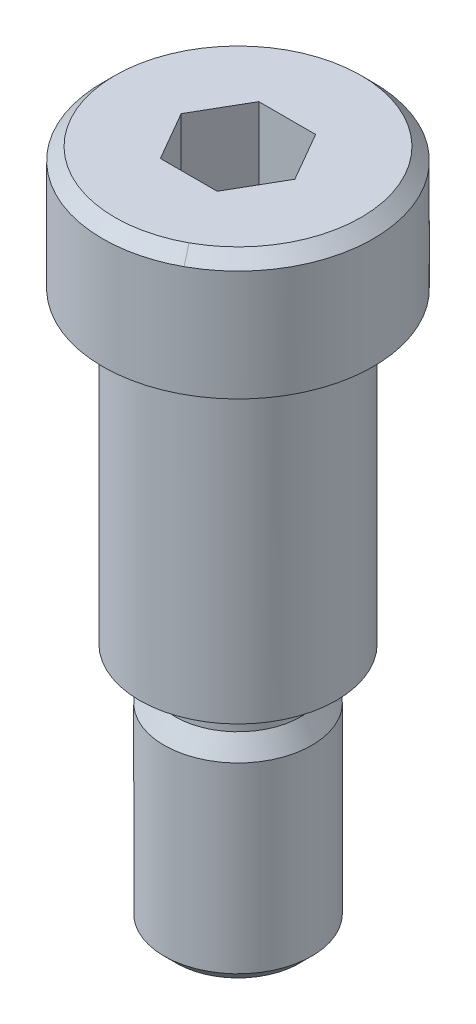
ISO-10303-21;
HEADER;
FILE_DESCRIPTION(('STEP AP214'),'2;1');
FILE_NAME('part.step','',(''),(''),'','','');
FILE_SCHEMA(('AUTOMOTIVE_DESIGN { 1 0 10303 214 1 1 1 1 }'));
ENDSEC;
DATA;
#1=APPLICATION_CONTEXT('core data for automotive mechanical design processes');
#2=APPLICATION_PROTOCOL_DEFINITION('international standard','automotive_design',2000,#1);
#3=PRODUCT_CONTEXT('',#1,'mechanical');
#4=PRODUCT('Part','Part','',(#3));
#5=PRODUCT_RELATED_PRODUCT_CATEGORY('part','',(#4));
#6=PRODUCT_DEFINITION_FORMATION('','',#4);
#7=PRODUCT_DEFINITION_CONTEXT('part definition',#1,'design');
#8=PRODUCT_DEFINITION('design','',#6,#7);
#9=PRODUCT_DEFINITION_SHAPE('','',#8);
#10=(LENGTH_UNIT() NAMED_UNIT(*) SI_UNIT(.MILLI.,.METRE.));
#11=(NAMED_UNIT(*) PLANE_ANGLE_UNIT() SI_UNIT($,.RADIAN.));
#12=(NAMED_UNIT(*) SI_UNIT($,.STERADIAN.) SOLID_ANGLE_UNIT());
#13=UNCERTAINTY_MEASURE_WITH_UNIT(LENGTH_MEASURE(1.E-05),#10,'distance_accuracy_value','');
#14=(GEOMETRIC_REPRESENTATION_CONTEXT(3) GLOBAL_UNCERTAINTY_ASSIGNED_CONTEXT((#13)) GLOBAL_UNIT_ASSIGNED_CONTEXT((#10,
#11,#12)) REPRESENTATION_CONTEXT('',''));
#15=CARTESIAN_POINT('',(0.,0.,0.));
#16=DIRECTION('',(0.,0.,1.));
#17=DIRECTION('',(1.,0.,0.));
#18=AXIS2_PLACEMENT_3D('',#15,#16,#17);
#19=CARTESIAN_POINT('',(0.,-55.,6.00000000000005));
#20=DIRECTION('',(0.,1.,0.));
#21=DIRECTION('',(0.,0.,1.));
#22=AXIS2_PLACEMENT_3D('',#19,#20,#21);
#23=PLANE('',#22);
#24=CARTESIAN_POINT('',(0.,-55.0000000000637,0.));
#25=DIRECTION('',(0.,1.,0.));
#26=DIRECTION('',(-1.,0.,0.));
#27=AXIS2_PLACEMENT_3D('',#24,#25,#26);
#28=CIRCLE('',#27,5.00000000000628);
#29=CARTESIAN_POINT('',(-5.00000000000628,-55.0000000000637,0.));
#30=VERTEX_POINT('',#29);
#31=EDGE_CURVE('E187',#30,#30,#28,.T.);
#32=ORIENTED_EDGE('',*,*,#31,.F.);
#33=EDGE_LOOP('',(#32));
#34=FACE_BOUND('',#33,.T.);
#35=ADVANCED_FACE('F30',(#34),#23,.F.);
#36=CARTESIAN_POINT('',(0.,-54.0000000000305,0.));
#37=DIRECTION('',(0.,1.,0.));
#38=DIRECTION('',(-1.,0.,0.));
#39=AXIS2_PLACEMENT_3D('',#36,#37,#38);
#40=CONICAL_SURFACE('',#39,6.00000000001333,0.785398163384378);
#41=ORIENTED_EDGE('',*,*,#31,.T.);
#42=EDGE_LOOP('',(#41));
#43=FACE_BOUND('',#42,.T.);
#44=CARTESIAN_POINT('',(0.,-54.,0.));
#45=DIRECTION('',(0.,1.,0.));
#46=DIRECTION('',(0.,0.,1.));
#47=AXIS2_PLACEMENT_3D('',#44,#45,#46);
#48=CIRCLE('',#47,6.);
#49=CARTESIAN_POINT('',(0.,-54.,6.00000000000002));
#50=VERTEX_POINT('',#49);
#51=EDGE_CURVE('E87',#50,#50,#48,.T.);
#52=ORIENTED_EDGE('',*,*,#51,.F.);
#53=EDGE_LOOP('',(#52));
#54=FACE_BOUND('',#53,.T.);
#55=ADVANCED_FACE('F412',(#43,#54),#40,.T.);
#56=CARTESIAN_POINT('',(0.,0.,0.));
#57=DIRECTION('',(0.,1.,0.));
#58=DIRECTION('',(0.,0.,1.));
#59=AXIS2_PLACEMENT_3D('',#56,#57,#58);
#60=PLANE('',#59);
#61=DIRECTION('',(0.5,0.,-0.86602540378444));
#62=VECTOR('',#61,1.);
#63=CARTESIAN_POINT('',(2.30940107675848,0.,3.99999999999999));
#64=LINE('',#63,#62);
#65=CARTESIAN_POINT('',(2.30940107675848,0.,3.99999999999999));
#66=VERTEX_POINT('',#65);
#67=CARTESIAN_POINT('',(4.61880215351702,0.,0.));
#68=VERTEX_POINT('',#67);
#69=EDGE_CURVE('E49',#66,#68,#64,.T.);
#70=ORIENTED_EDGE('',*,*,#69,.F.);
#71=DIRECTION('',(1.,0.,0.));
#72=VECTOR('',#71,1.);
#73=CARTESIAN_POINT('',(-2.30940107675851,0.,3.99999999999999));
#74=LINE('',#73,#72);
#75=CARTESIAN_POINT('',(-2.30940107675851,0.,3.99999999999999));
#76=VERTEX_POINT('',#75);
#77=EDGE_CURVE('E292',#76,#66,#74,.T.);
#78=ORIENTED_EDGE('',*,*,#77,.F.);
#79=DIRECTION('',(0.500000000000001,0.,0.86602540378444));
#80=VECTOR('',#79,1.);
#81=CARTESIAN_POINT('',(-4.61880215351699,0.,0.));
#82=LINE('',#81,#80);
#83=CARTESIAN_POINT('',(-4.61880215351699,0.,0.));
#84=VERTEX_POINT('',#83);
#85=EDGE_CURVE('E286',#84,#76,#82,.T.);
#86=ORIENTED_EDGE('',*,*,#85,.F.);
#87=DIRECTION('',(-0.5,0.,0.86602540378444));
#88=VECTOR('',#87,1.);
#89=CARTESIAN_POINT('',(-2.30940107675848,0.,-4.00000000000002));
#90=LINE('',#89,#88);
#91=CARTESIAN_POINT('',(-2.30940107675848,0.,-4.00000000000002));
#92=VERTEX_POINT('',#91);
#93=EDGE_CURVE('E284',#92,#84,#90,.T.);
#94=ORIENTED_EDGE('',*,*,#93,.F.);
#95=DIRECTION('',(-1.,0.,0.));
#96=VECTOR('',#95,1.);
#97=CARTESIAN_POINT('',(2.3094010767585,0.,-4.00000000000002));
#98=LINE('',#97,#96);
#99=CARTESIAN_POINT('',(2.3094010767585,0.,-4.00000000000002));
#100=VERTEX_POINT('',#99);
#101=EDGE_CURVE('E269',#100,#92,#98,.T.);
#102=ORIENTED_EDGE('',*,*,#101,.F.);
#103=DIRECTION('',(-0.500000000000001,0.,-0.86602540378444));
#104=VECTOR('',#103,1.);
#105=CARTESIAN_POINT('',(4.61880215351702,0.,0.));
#106=LINE('',#105,#104);
#107=EDGE_CURVE('E278',#68,#100,#106,.T.);
#108=ORIENTED_EDGE('',*,*,#107,.F.);
#109=EDGE_LOOP('',(#70,#78,#86,#94,#102,#108));
#110=FACE_BOUND('',#109,.T.);
#111=CARTESIAN_POINT('',(0.,0.,0.));
#112=DIRECTION('',(0.,-1.,0.));
#113=DIRECTION('',(1.,0.,0.));
#114=AXIS2_PLACEMENT_3D('',#111,#112,#113);
#115=CIRCLE('',#114,9.99999999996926);
#116=CARTESIAN_POINT('',(4.79425538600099,2.84182399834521E-11,8.77582561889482));
#117=VERTEX_POINT('',#116);
#118=CARTESIAN_POINT('',(-4.79425620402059,0.,-8.77582517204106));
#119=VERTEX_POINT('',#118);
#120=EDGE_CURVE('E77',#117,#119,#115,.T.);
#121=ORIENTED_EDGE('',*,*,#120,.F.);
#122=CARTESIAN_POINT('',(0.,0.,0.));
#123=DIRECTION('',(0.,-1.,0.));
#124=DIRECTION('',(1.,0.,0.));
#125=AXIS2_PLACEMENT_3D('',#122,#123,#124);
#126=CIRCLE('',#125,10.0000000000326);
#127=EDGE_CURVE('E89',#119,#117,#126,.T.);
#128=ORIENTED_EDGE('',*,*,#127,.F.);
#129=EDGE_LOOP('',(#121,#128));
#130=FACE_BOUND('',#129,.T.);
#131=ADVANCED_FACE('F90',(#110,#130),#60,.T.);
#132=CARTESIAN_POINT('',(0.,-27.5,0.));
#133=DIRECTION('',(0.,1.,0.));
#134=DIRECTION('',(0.,0.,1.));
#135=AXIS2_PLACEMENT_3D('',#132,#133,#134);
#136=CYLINDRICAL_SURFACE('',#135,6.);
#137=CARTESIAN_POINT('',(0.,-39.1588457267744,0.));
#138=DIRECTION('',(0.,-1.,0.));
#139=DIRECTION('',(0.479425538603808,0.,0.87758256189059));
#140=AXIS2_PLACEMENT_3D('',#137,#138,#139);
#141=CIRCLE('',#140,5.99999999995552);
#142=CARTESIAN_POINT('',(2.87655323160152,-39.1588457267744,5.26549537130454));
#143=VERTEX_POINT('',#142);
#144=EDGE_CURVE('E92',#143,#143,#141,.F.);
#145=ORIENTED_EDGE('',*,*,#144,.F.);
#146=EDGE_LOOP('',(#145));
#147=FACE_BOUND('',#146,.T.);
#148=ORIENTED_EDGE('',*,*,#51,.T.);
#149=EDGE_LOOP('',(#148));
#150=FACE_BOUND('',#149,.T.);
#151=ADVANCED_FACE('F400',(#147,#150),#136,.T.);
#152=CARTESIAN_POINT('',(0.,-1.00000000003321,0.));
#153=DIRECTION('',(0.,-1.,0.));
#154=DIRECTION('',(1.,0.,0.));
#155=AXIS2_PLACEMENT_3D('',#152,#153,#154);
#156=CONICAL_SURFACE('',#155,11.0000000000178,0.785398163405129);
#157=DIRECTION('',(-0.339005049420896,0.707106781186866,-0.620544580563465));
#158=VECTOR('',#157,1.);
#159=CARTESIAN_POINT('',(239238.13801867,-499000.,437922.47420852));
#160=LINE('',#159,#158);
#161=CARTESIAN_POINT('',(5.27368092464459,-0.999999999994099,9.65340818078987));
#162=VERTEX_POINT('',#161);
#163=EDGE_CURVE('E84',#117,#162,#160,.F.);
#164=ORIENTED_EDGE('',*,*,#163,.F.);
#165=ORIENTED_EDGE('',*,*,#120,.T.);
#166=CARTESIAN_POINT('',(-5.2736809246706,-0.999999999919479,-9.65340818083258));
#167=CARTESIAN_POINT('',(-5.25370489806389,-0.958333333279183,-9.6168422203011));
#168=CARTESIAN_POINT('',(-5.23372887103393,-0.916666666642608,-9.5802762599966));
#169=CARTESIAN_POINT('',(-5.19377681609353,-0.833333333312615,-9.50714433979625));
#170=CARTESIAN_POINT('',(-5.17380078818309,-0.791666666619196,-9.47057837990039));
#171=CARTESIAN_POINT('',(-5.13384873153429,-0.708333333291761,-9.39744646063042));
#172=CARTESIAN_POINT('',(-5.11387270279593,-0.666666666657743,-9.36088050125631));
#173=CARTESIAN_POINT('',(-5.07392064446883,-0.583333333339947,-9.28774858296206));
#174=CARTESIAN_POINT('',(-5.05394461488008,-0.541666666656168,-9.25118262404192));
#175=CARTESIAN_POINT('',(-5.0139925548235,-0.458333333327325,-9.17805070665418));
#176=CARTESIAN_POINT('',(-4.99401652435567,-0.41666666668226,-9.14148474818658));
#177=CARTESIAN_POINT('',(-4.95406446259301,-0.333333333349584,-9.06835283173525));
#178=CARTESIAN_POINT('',(-4.93408843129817,-0.291666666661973,-9.03178687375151));
#179=CARTESIAN_POINT('',(-4.894136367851,-0.208333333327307,-8.95865495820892));
#180=CARTESIAN_POINT('',(-4.87416033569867,-0.166666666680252,-8.92208900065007));
#181=CARTESIAN_POINT('',(-4.83420827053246,-0.0833333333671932,-8.8489570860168));
#182=CARTESIAN_POINT('',(-4.81423223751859,-0.04166666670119,-8.81239112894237));
#183=CARTESIAN_POINT('',(-4.79425620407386,0.,-8.77582517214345));
#184=B_SPLINE_CURVE_WITH_KNOTS('',3,(#166,#167,#168,#169,#170,#171,#172,#173,#174,#175,#176,
#177,#178,#179,#180,#181,#182,#183),.UNSPECIFIED.,.F.,.F.,(4,2,2,2,2,2,2,2,4),(0.,
0.176776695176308,0.353553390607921,0.530330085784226,0.707106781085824,0.883883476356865,
1.06066017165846,1.23743686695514,1.41421356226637),.UNSPECIFIED.);
#185=CARTESIAN_POINT('',(-5.2736809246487,-0.999999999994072,-9.65340818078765));
#186=VERTEX_POINT('',#185);
#187=EDGE_CURVE('E81',#186,#119,#184,.T.);
#188=ORIENTED_EDGE('',*,*,#187,.F.);
#189=CARTESIAN_POINT('',(0.,-0.999999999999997,0.));
#190=DIRECTION('',(0.,1.,0.));
#191=DIRECTION('',(0.,0.,1.));
#192=AXIS2_PLACEMENT_3D('',#189,#190,#191);
#193=CIRCLE('',#192,11.);
#194=EDGE_CURVE('E199',#162,#186,#193,.F.);
#195=ORIENTED_EDGE('',*,*,#194,.F.);
#196=EDGE_LOOP('',(#164,#165,#188,#195));
#197=FACE_BOUND('',#196,.T.);
#198=ADVANCED_FACE('F79',(#197),#156,.T.);
#199=CARTESIAN_POINT('',(0.,-0.999999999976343,0.));
#200=DIRECTION('',(0.,-1.,0.));
#201=DIRECTION('',(1.,0.,0.));
#202=AXIS2_PLACEMENT_3D('',#199,#200,#201);
#203=CONICAL_SURFACE('',#202,10.999999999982,0.785398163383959);
#204=ORIENTED_EDGE('',*,*,#187,.T.);
#205=ORIENTED_EDGE('',*,*,#127,.T.);
#206=ORIENTED_EDGE('',*,*,#163,.T.);
#207=CARTESIAN_POINT('',(0.,-0.999999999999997,0.));
#208=DIRECTION('',(0.,1.,0.));
#209=DIRECTION('',(0.,0.,1.));
#210=AXIS2_PLACEMENT_3D('',#207,#208,#209);
#211=CIRCLE('',#210,11.);
#212=EDGE_CURVE('E97',#186,#162,#211,.F.);
#213=ORIENTED_EDGE('',*,*,#212,.F.);
#214=EDGE_LOOP('',(#204,#205,#206,#213));
#215=FACE_BOUND('',#214,.T.);
#216=ADVANCED_FACE('F95',(#215),#203,.T.);
#217=CARTESIAN_POINT('',(0.,-39.1588457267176,0.));
#218=DIRECTION('',(0.,-1.,0.));
#219=DIRECTION('',(0.,0.,-1.));
#220=AXIS2_PLACEMENT_3D('',#217,#218,#219);
#221=CONICAL_SURFACE('',#220,5.99999999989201,0.52359877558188);
#222=ORIENTED_EDGE('',*,*,#144,.T.);
#223=EDGE_LOOP('',(#222));
#224=FACE_BOUND('',#223,.T.);
#225=CARTESIAN_POINT('',(0.,-37.6,0.));
#226=DIRECTION('',(0.,1.,0.));
#227=DIRECTION('',(0.,0.,1.));
#228=AXIS2_PLACEMENT_3D('',#225,#226,#227);
#229=CIRCLE('',#228,5.1);
#230=CARTESIAN_POINT('',(0.,-37.6,5.10000000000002));
#231=VERTEX_POINT('',#230);
#232=EDGE_CURVE('E194',#231,#231,#229,.T.);
#233=ORIENTED_EDGE('',*,*,#232,.F.);
#234=EDGE_LOOP('',(#233));
#235=FACE_BOUND('',#234,.T.);
#236=ADVANCED_FACE('F383',(#224,#235),#221,.T.);
#237=CARTESIAN_POINT('',(0.,-27.5,0.));
#238=DIRECTION('',(0.,1.,0.));
#239=DIRECTION('',(0.,0.,1.));
#240=AXIS2_PLACEMENT_3D('',#237,#238,#239);
#241=CYLINDRICAL_SURFACE('',#240,11.);
#242=CARTESIAN_POINT('',(0.,-9.99999999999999,0.));
#243=DIRECTION('',(0.,1.,0.));
#244=DIRECTION('',(0.,0.,1.));
#245=AXIS2_PLACEMENT_3D('',#242,#243,#244);
#246=CIRCLE('',#245,11.);
#247=CARTESIAN_POINT('',(0.,-9.99999999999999,11.));
#248=VERTEX_POINT('',#247);
#249=EDGE_CURVE('E191',#248,#248,#246,.T.);
#250=ORIENTED_EDGE('',*,*,#249,.T.);
#251=EDGE_LOOP('',(#250));
#252=FACE_BOUND('',#251,.T.);
#253=ORIENTED_EDGE('',*,*,#212,.T.);
#254=ORIENTED_EDGE('',*,*,#194,.T.);
#255=EDGE_LOOP('',(#253,#254));
#256=FACE_BOUND('',#255,.T.);
#257=ADVANCED_FACE('F376',(#252,#256),#241,.T.);
#258=CARTESIAN_POINT('',(0.,-27.5,0.));
#259=DIRECTION('',(0.,1.,0.));
#260=DIRECTION('',(0.,0.,1.));
#261=AXIS2_PLACEMENT_3D('',#258,#259,#260);
#262=CYLINDRICAL_SURFACE('',#261,5.1);
#263=ORIENTED_EDGE('',*,*,#232,.T.);
#264=EDGE_LOOP('',(#263));
#265=FACE_BOUND('',#264,.T.);
#266=CARTESIAN_POINT('',(0.,-35.9,0.));
#267=DIRECTION('',(0.,1.,0.));
#268=DIRECTION('',(0.479425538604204,0.,0.877582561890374));
#269=AXIS2_PLACEMENT_3D('',#266,#267,#268);
#270=CIRCLE('',#269,5.1);
#271=CARTESIAN_POINT('',(2.44507024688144,-35.9,4.47567106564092));
#272=VERTEX_POINT('',#271);
#273=EDGE_CURVE('E193',#272,#272,#270,.F.);
#274=ORIENTED_EDGE('',*,*,#273,.T.);
#275=EDGE_LOOP('',(#274));
#276=FACE_BOUND('',#275,.T.);
#277=ADVANCED_FACE('F146',(#265,#276),#262,.T.);
#278=CARTESIAN_POINT('',(0.,-10.,11.));
#279=DIRECTION('',(0.,1.,0.));
#280=DIRECTION('',(0.,0.,1.));
#281=AXIS2_PLACEMENT_3D('',#278,#279,#280);
#282=PLANE('',#281);
#283=CARTESIAN_POINT('',(0.,-10.,0.));
#284=DIRECTION('',(0.,-1.,0.));
#285=DIRECTION('',(-0.47942553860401,0.,-0.877582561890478));
#286=AXIS2_PLACEMENT_3D('',#283,#284,#285);
#287=CIRCLE('',#286,7.99999999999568);
#288=CARTESIAN_POINT('',(3.83540430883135,-10.,7.02066049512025));
#289=VERTEX_POINT('',#288);
#290=CARTESIAN_POINT('',(-3.83540430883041,-9.99999999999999,-7.0206604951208));
#291=VERTEX_POINT('',#290);
#292=EDGE_CURVE('E129',#289,#291,#287,.F.);
#293=ORIENTED_EDGE('',*,*,#292,.T.);
#294=CARTESIAN_POINT('',(0.,-10.,0.));
#295=DIRECTION('',(0.,-1.,0.));
#296=DIRECTION('',(0.479425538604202,0.,0.877582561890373));
#297=AXIS2_PLACEMENT_3D('',#294,#295,#296);
#298=CIRCLE('',#297,7.99999999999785);
#299=EDGE_CURVE('E212',#291,#289,#298,.F.);
#300=ORIENTED_EDGE('',*,*,#299,.T.);
#301=EDGE_LOOP('',(#293,#300));
#302=FACE_BOUND('',#301,.T.);
#303=ORIENTED_EDGE('',*,*,#249,.F.);
#304=EDGE_LOOP('',(#303));
#305=FACE_BOUND('',#304,.T.);
#306=ADVANCED_FACE('F136',(#302,#305),#282,.F.);
#307=CARTESIAN_POINT('',(0.,-35.9,0.));
#308=DIRECTION('',(0.,1.,0.));
#309=DIRECTION('',(0.479425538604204,0.,0.877582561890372));
#310=AXIS2_PLACEMENT_3D('',#307,#308,#309);
#311=TOROIDAL_SURFACE('',#310,6.00000000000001,0.9);
#312=ORIENTED_EDGE('',*,*,#273,.F.);
#313=EDGE_LOOP('',(#312));
#314=FACE_BOUND('',#313,.T.);
#315=CARTESIAN_POINT('',(0.,-35.,0.));
#316=DIRECTION('',(0.,-1.,0.));
#317=DIRECTION('',(0.479425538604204,0.,0.877582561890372));
#318=AXIS2_PLACEMENT_3D('',#315,#316,#317);
#319=CIRCLE('',#318,6.00000000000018);
#320=CARTESIAN_POINT('',(2.87655323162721,-35.,5.26549537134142));
#321=VERTEX_POINT('',#320);
#322=CARTESIAN_POINT('',(-2.87655323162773,-35.,-5.26549537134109));
#323=VERTEX_POINT('',#322);
#324=EDGE_CURVE('E213',#321,#323,#319,.T.);
#325=ORIENTED_EDGE('',*,*,#324,.T.);
#326=CARTESIAN_POINT('',(0.,-35.,0.));
#327=DIRECTION('',(0.,-1.,0.));
#328=DIRECTION('',(-0.479425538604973,0.,-0.877582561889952));
#329=AXIS2_PLACEMENT_3D('',#326,#327,#328);
#330=CIRCLE('',#329,6.00000000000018);
#331=EDGE_CURVE('E57',#323,#321,#330,.T.);
#332=ORIENTED_EDGE('',*,*,#331,.T.);
#333=EDGE_LOOP('',(#325,#332));
#334=FACE_BOUND('',#333,.T.);
#335=ADVANCED_FACE('F145',(#314,#334),#311,.F.);
#336=CARTESIAN_POINT('',(0.,-10.9,0.));
#337=DIRECTION('',(0.,1.,0.));
#338=DIRECTION('',(0.479425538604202,0.,0.877582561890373));
#339=AXIS2_PLACEMENT_3D('',#336,#337,#338);
#340=TOROIDAL_SURFACE('',#339,8.00000000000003,0.9);
#341=CARTESIAN_POINT('',(0.,-11.8,0.));
#342=DIRECTION('',(0.,1.,0.));
#343=DIRECTION('',(0.,0.,1.));
#344=AXIS2_PLACEMENT_3D('',#341,#342,#343);
#345=CIRCLE('',#344,8.);
#346=CARTESIAN_POINT('',(0.,-11.8,8.00000000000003));
#347=VERTEX_POINT('',#346);
#348=EDGE_CURVE('E41',#347,#347,#345,.F.);
#349=ORIENTED_EDGE('',*,*,#348,.F.);
#350=EDGE_LOOP('',(#349));
#351=FACE_BOUND('',#350,.T.);
#352=ORIENTED_EDGE('',*,*,#299,.F.);
#353=ORIENTED_EDGE('',*,*,#292,.F.);
#354=EDGE_LOOP('',(#352,#353));
#355=FACE_BOUND('',#354,.T.);
#356=ADVANCED_FACE('F164',(#351,#355),#340,.F.);
#357=CARTESIAN_POINT('',(0.,-35.,7.99999999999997));
#358=DIRECTION('',(0.,1.,0.));
#359=DIRECTION('',(0.,0.,1.));
#360=AXIS2_PLACEMENT_3D('',#357,#358,#359);
#361=PLANE('',#360);
#362=ORIENTED_EDGE('',*,*,#331,.F.);
#363=ORIENTED_EDGE('',*,*,#324,.F.);
#364=EDGE_LOOP('',(#362,#363));
#365=FACE_BOUND('',#364,.T.);
#366=CARTESIAN_POINT('',(0.,-35.,0.));
#367=DIRECTION('',(0.,1.,0.));
#368=DIRECTION('',(0.,0.,1.));
#369=AXIS2_PLACEMENT_3D('',#366,#367,#368);
#370=CIRCLE('',#369,8.);
#371=CARTESIAN_POINT('',(0.,-35.,8.00000000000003));
#372=VERTEX_POINT('',#371);
#373=EDGE_CURVE('E11',#372,#372,#370,.T.);
#374=ORIENTED_EDGE('',*,*,#373,.F.);
#375=EDGE_LOOP('',(#374));
#376=FACE_BOUND('',#375,.T.);
#377=ADVANCED_FACE('F167',(#365,#376),#361,.F.);
#378=CARTESIAN_POINT('',(0.,-27.5,0.));
#379=DIRECTION('',(0.,1.,0.));
#380=DIRECTION('',(0.,0.,1.));
#381=AXIS2_PLACEMENT_3D('',#378,#379,#380);
#382=CYLINDRICAL_SURFACE('',#381,8.);
#383=ORIENTED_EDGE('',*,*,#373,.T.);
#384=EDGE_LOOP('',(#383));
#385=FACE_BOUND('',#384,.T.);
#386=ORIENTED_EDGE('',*,*,#348,.T.);
#387=EDGE_LOOP('',(#386));
#388=FACE_BOUND('',#387,.T.);
#389=ADVANCED_FACE('F32',(#385,#388),#382,.T.);
#390=CARTESIAN_POINT('',(2.30940107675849,-5.99999999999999,4.));
#391=DIRECTION('',(0.86602540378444,0.,0.5));
#392=DIRECTION('',(0.5,0.,-0.86602540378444));
#393=AXIS2_PLACEMENT_3D('',#390,#391,#392);
#394=PLANE('',#393);
#395=ORIENTED_EDGE('',*,*,#69,.T.);
#396=DIRECTION('',(0.,1.,0.));
#397=VECTOR('',#396,1.);
#398=CARTESIAN_POINT('',(4.61880215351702,-6.00000000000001,0.));
#399=LINE('',#398,#397);
#400=CARTESIAN_POINT('',(4.61880215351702,-6.00000000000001,0.));
#401=VERTEX_POINT('',#400);
#402=EDGE_CURVE('E122',#401,#68,#399,.T.);
#403=ORIENTED_EDGE('',*,*,#402,.F.);
#404=DIRECTION('',(0.5,0.,-0.86602540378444));
#405=VECTOR('',#404,1.);
#406=CARTESIAN_POINT('',(2.30940107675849,-5.99999999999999,4.));
#407=LINE('',#406,#405);
#408=CARTESIAN_POINT('',(2.30940107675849,-5.99999999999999,4.));
#409=VERTEX_POINT('',#408);
#410=EDGE_CURVE('E295',#409,#401,#407,.T.);
#411=ORIENTED_EDGE('',*,*,#410,.F.);
#412=DIRECTION('',(0.,1.,0.));
#413=VECTOR('',#412,1.);
#414=CARTESIAN_POINT('',(2.30940107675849,-5.99999999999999,4.));
#415=LINE('',#414,#413);
#416=EDGE_CURVE('E189',#409,#66,#415,.T.);
#417=ORIENTED_EDGE('',*,*,#416,.T.);
#418=EDGE_LOOP('',(#395,#403,#411,#417));
#419=FACE_BOUND('',#418,.T.);
#420=ADVANCED_FACE('F323',(#419),#394,.F.);
#421=CARTESIAN_POINT('',(-2.30940107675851,-5.99999999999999,3.99999999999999));
#422=DIRECTION('',(0.,0.,1.));
#423=DIRECTION('',(1.,0.,0.));
#424=AXIS2_PLACEMENT_3D('',#421,#422,#423);
#425=PLANE('',#424);
#426=ORIENTED_EDGE('',*,*,#77,.T.);
#427=ORIENTED_EDGE('',*,*,#416,.F.);
#428=DIRECTION('',(1.,0.,0.));
#429=VECTOR('',#428,1.);
#430=CARTESIAN_POINT('',(-2.30940107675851,-5.99999999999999,3.99999999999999));
#431=LINE('',#430,#429);
#432=CARTESIAN_POINT('',(-2.30940107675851,-5.99999999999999,3.99999999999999));
#433=VERTEX_POINT('',#432);
#434=EDGE_CURVE('E307',#433,#409,#431,.T.);
#435=ORIENTED_EDGE('',*,*,#434,.F.);
#436=DIRECTION('',(0.,1.,0.));
#437=VECTOR('',#436,1.);
#438=CARTESIAN_POINT('',(-2.30940107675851,-5.99999999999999,3.99999999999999));
#439=LINE('',#438,#437);
#440=EDGE_CURVE('E311',#433,#76,#439,.T.);
#441=ORIENTED_EDGE('',*,*,#440,.T.);
#442=EDGE_LOOP('',(#426,#427,#435,#441));
#443=FACE_BOUND('',#442,.T.);
#444=ADVANCED_FACE('F326',(#443),#425,.F.);
#445=CARTESIAN_POINT('',(-4.618802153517,-5.99999999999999,0.));
#446=DIRECTION('',(-0.866025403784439,0.,0.500000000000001));
#447=DIRECTION('',(0.500000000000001,0.,0.86602540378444));
#448=AXIS2_PLACEMENT_3D('',#445,#446,#447);
#449=PLANE('',#448);
#450=ORIENTED_EDGE('',*,*,#85,.T.);
#451=ORIENTED_EDGE('',*,*,#440,.F.);
#452=DIRECTION('',(0.500000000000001,0.,0.86602540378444));
#453=VECTOR('',#452,1.);
#454=CARTESIAN_POINT('',(-4.618802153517,-5.99999999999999,0.));
#455=LINE('',#454,#453);
#456=CARTESIAN_POINT('',(-4.618802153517,-5.99999999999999,0.));
#457=VERTEX_POINT('',#456);
#458=EDGE_CURVE('E304',#457,#433,#455,.T.);
#459=ORIENTED_EDGE('',*,*,#458,.F.);
#460=DIRECTION('',(0.,1.,0.));
#461=VECTOR('',#460,1.);
#462=CARTESIAN_POINT('',(-4.618802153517,-5.99999999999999,0.));
#463=LINE('',#462,#461);
#464=EDGE_CURVE('E313',#457,#84,#463,.T.);
#465=ORIENTED_EDGE('',*,*,#464,.T.);
#466=EDGE_LOOP('',(#450,#451,#459,#465));
#467=FACE_BOUND('',#466,.T.);
#468=ADVANCED_FACE('F328',(#467),#449,.F.);
#469=CARTESIAN_POINT('',(-2.30940107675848,-6.,-3.99999999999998));
#470=DIRECTION('',(-0.86602540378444,0.,-0.5));
#471=DIRECTION('',(-0.5,0.,0.86602540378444));
#472=AXIS2_PLACEMENT_3D('',#469,#470,#471);
#473=PLANE('',#472);
#474=ORIENTED_EDGE('',*,*,#93,.T.);
#475=ORIENTED_EDGE('',*,*,#464,.F.);
#476=DIRECTION('',(-0.5,0.,0.86602540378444));
#477=VECTOR('',#476,1.);
#478=CARTESIAN_POINT('',(-2.30940107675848,-6.,-3.99999999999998));
#479=LINE('',#478,#477);
#480=CARTESIAN_POINT('',(-2.30940107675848,-6.,-3.99999999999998));
#481=VERTEX_POINT('',#480);
#482=EDGE_CURVE('E301',#481,#457,#479,.T.);
#483=ORIENTED_EDGE('',*,*,#482,.F.);
#484=DIRECTION('',(0.,1.,0.));
#485=VECTOR('',#484,1.);
#486=CARTESIAN_POINT('',(-2.30940107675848,-6.,-3.99999999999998));
#487=LINE('',#486,#485);
#488=EDGE_CURVE('E276',#481,#92,#487,.T.);
#489=ORIENTED_EDGE('',*,*,#488,.T.);
#490=EDGE_LOOP('',(#474,#475,#483,#489));
#491=FACE_BOUND('',#490,.T.);
#492=ADVANCED_FACE('F317',(#491),#473,.F.);
#493=CARTESIAN_POINT('',(2.3094010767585,-6.00000000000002,-4.00000000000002));
#494=DIRECTION('',(0.,0.,-1.));
#495=DIRECTION('',(-1.,0.,0.));
#496=AXIS2_PLACEMENT_3D('',#493,#494,#495);
#497=PLANE('',#496);
#498=ORIENTED_EDGE('',*,*,#101,.T.);
#499=ORIENTED_EDGE('',*,*,#488,.F.);
#500=DIRECTION('',(-1.,0.,0.));
#501=VECTOR('',#500,1.);
#502=CARTESIAN_POINT('',(2.3094010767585,-6.00000000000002,-4.00000000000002));
#503=LINE('',#502,#501);
#504=CARTESIAN_POINT('',(2.3094010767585,-6.00000000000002,-4.00000000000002));
#505=VERTEX_POINT('',#504);
#506=EDGE_CURVE('E272',#505,#481,#503,.T.);
#507=ORIENTED_EDGE('',*,*,#506,.F.);
#508=DIRECTION('',(0.,1.,0.));
#509=VECTOR('',#508,1.);
#510=CARTESIAN_POINT('',(2.3094010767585,-6.00000000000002,-4.00000000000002));
#511=LINE('',#510,#509);
#512=EDGE_CURVE('E265',#505,#100,#511,.T.);
#513=ORIENTED_EDGE('',*,*,#512,.T.);
#514=EDGE_LOOP('',(#498,#499,#507,#513));
#515=FACE_BOUND('',#514,.T.);
#516=ADVANCED_FACE('F267',(#515),#497,.F.);
#517=CARTESIAN_POINT('',(4.61880215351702,-6.00000000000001,0.));
#518=DIRECTION('',(0.86602540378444,0.,-0.5));
#519=DIRECTION('',(-0.500000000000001,0.,-0.86602540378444));
#520=AXIS2_PLACEMENT_3D('',#517,#518,#519);
#521=PLANE('',#520);
#522=ORIENTED_EDGE('',*,*,#107,.T.);
#523=ORIENTED_EDGE('',*,*,#512,.F.);
#524=DIRECTION('',(-0.500000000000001,0.,-0.86602540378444));
#525=VECTOR('',#524,1.);
#526=CARTESIAN_POINT('',(4.61880215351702,-6.00000000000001,0.));
#527=LINE('',#526,#525);
#528=EDGE_CURVE('E298',#401,#505,#527,.T.);
#529=ORIENTED_EDGE('',*,*,#528,.F.);
#530=ORIENTED_EDGE('',*,*,#402,.T.);
#531=EDGE_LOOP('',(#522,#523,#529,#530));
#532=FACE_BOUND('',#531,.T.);
#533=ADVANCED_FACE('F279',(#532),#521,.F.);
#534=CARTESIAN_POINT('',(6.92820323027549,-6.,-4.00000000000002));
#535=DIRECTION('',(0.,1.,0.));
#536=DIRECTION('',(0.,0.,1.));
#537=AXIS2_PLACEMENT_3D('',#534,#535,#536);
#538=PLANE('',#537);
#539=ORIENTED_EDGE('',*,*,#410,.T.);
#540=ORIENTED_EDGE('',*,*,#528,.T.);
#541=ORIENTED_EDGE('',*,*,#506,.T.);
#542=ORIENTED_EDGE('',*,*,#482,.T.);
#543=ORIENTED_EDGE('',*,*,#458,.T.);
#544=ORIENTED_EDGE('',*,*,#434,.T.);
#545=EDGE_LOOP('',(#539,#540,#541,#542,#543,#544));
#546=FACE_BOUND('',#545,.T.);
#547=ADVANCED_FACE('F320',(#546),#538,.T.);
#548=CLOSED_SHELL('',(#35,#55,#131,#151,#198,#216,#236,#257,#277,#306,#335,#356,#377,#389,#420,
#444,#468,#492,#516,#533,#547));
#549=MANIFOLD_SOLID_BREP('B2',#548);
#550=ADVANCED_BREP_SHAPE_REPRESENTATION('',(#18,#549),#14);
#551=SHAPE_DEFINITION_REPRESENTATION(#9,#550);
ENDSEC;
END-ISO-10303-21;
